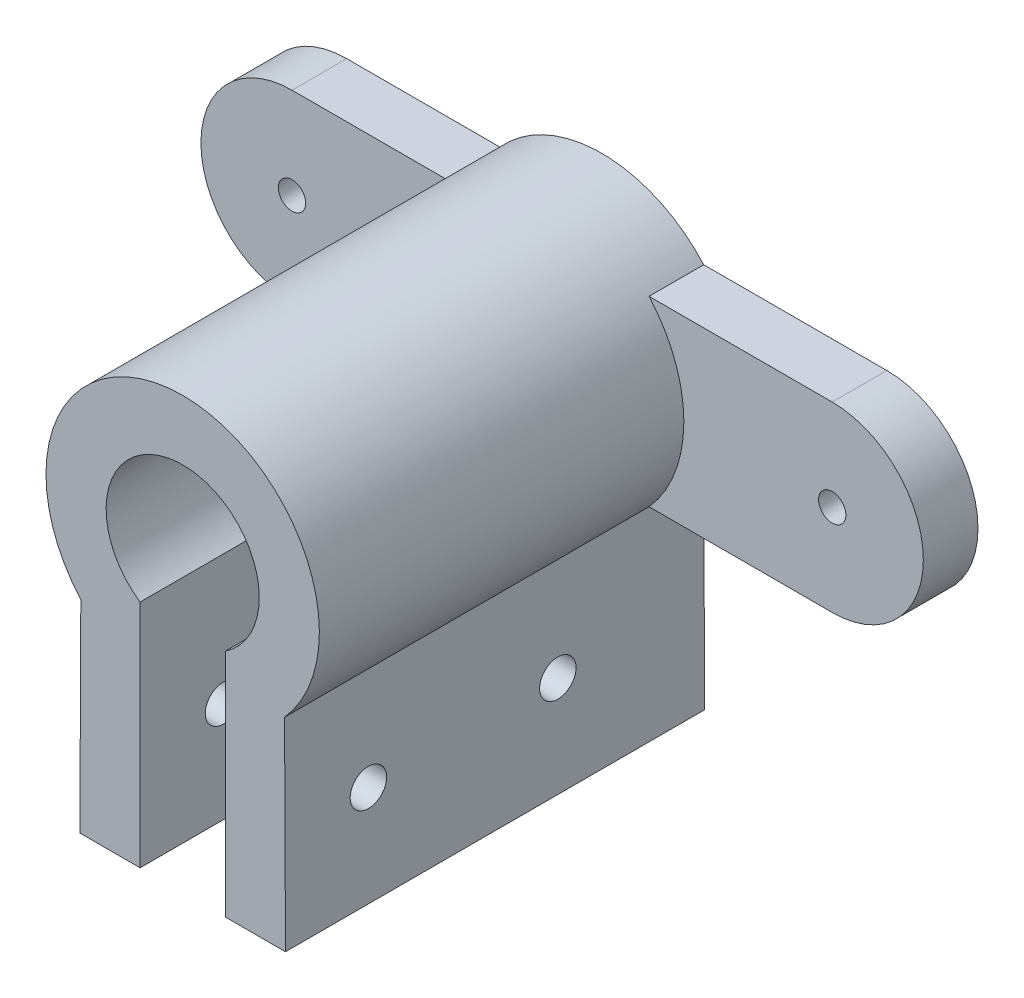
ISO-10303-21;
HEADER;
FILE_DESCRIPTION(('STEP AP214'),'2;1');
FILE_NAME('part.step','',(''),(''),'','','');
FILE_SCHEMA(('AUTOMOTIVE_DESIGN { 1 0 10303 214 1 1 1 1 }'));
ENDSEC;
DATA;
#1=APPLICATION_CONTEXT('core data for automotive mechanical design processes');
#2=APPLICATION_PROTOCOL_DEFINITION('international standard','automotive_design',2000,#1);
#3=PRODUCT_CONTEXT('',#1,'mechanical');
#4=PRODUCT('Part','Part','',(#3));
#5=PRODUCT_RELATED_PRODUCT_CATEGORY('part','',(#4));
#6=PRODUCT_DEFINITION_FORMATION('','',#4);
#7=PRODUCT_DEFINITION_CONTEXT('part definition',#1,'design');
#8=PRODUCT_DEFINITION('design','',#6,#7);
#9=PRODUCT_DEFINITION_SHAPE('','',#8);
#10=(LENGTH_UNIT() NAMED_UNIT(*) SI_UNIT(.MILLI.,.METRE.));
#11=(NAMED_UNIT(*) PLANE_ANGLE_UNIT() SI_UNIT($,.RADIAN.));
#12=(NAMED_UNIT(*) SI_UNIT($,.STERADIAN.) SOLID_ANGLE_UNIT());
#13=UNCERTAINTY_MEASURE_WITH_UNIT(LENGTH_MEASURE(1.E-05),#10,'distance_accuracy_value','');
#14=(GEOMETRIC_REPRESENTATION_CONTEXT(3) GLOBAL_UNCERTAINTY_ASSIGNED_CONTEXT((#13)) GLOBAL_UNIT_ASSIGNED_CONTEXT((#10,
#11,#12)) REPRESENTATION_CONTEXT('',''));
#15=CARTESIAN_POINT('',(0.,0.,0.));
#16=DIRECTION('',(0.,0.,1.));
#17=DIRECTION('',(1.,0.,0.));
#18=AXIS2_PLACEMENT_3D('',#15,#16,#17);
#19=CARTESIAN_POINT('',(-7.13042206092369,-254.782156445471,3.));
#20=DIRECTION('',(0.,0.,1.));
#21=DIRECTION('',(1.,0.,0.));
#22=AXIS2_PLACEMENT_3D('',#19,#20,#21);
#23=PLANE('',#22);
#24=CARTESIAN_POINT('',(-22.7704220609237,-254.782156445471,3.));
#25=DIRECTION('',(0.,0.,1.));
#26=DIRECTION('',(1.,0.,0.));
#27=AXIS2_PLACEMENT_3D('',#24,#25,#26);
#28=CIRCLE('',#27,7.5);
#29=CARTESIAN_POINT('',(-28.3605920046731,-249.782156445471,3.));
#30=VERTEX_POINT('',#29);
#31=CARTESIAN_POINT('',(-28.3605920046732,-259.782156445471,3.));
#32=VERTEX_POINT('',#31);
#33=EDGE_CURVE('E222',#30,#32,#28,.T.);
#34=ORIENTED_EDGE('',*,*,#33,.F.);
#35=DIRECTION('',(-1.,0.,0.));
#36=VECTOR('',#35,1.);
#37=CARTESIAN_POINT('',(-28.3605920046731,-249.782156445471,3.));
#38=LINE('',#37,#36);
#39=CARTESIAN_POINT('',(-36.7704220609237,-249.782156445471,3.));
#40=VERTEX_POINT('',#39);
#41=EDGE_CURVE('E258',#30,#40,#38,.T.);
#42=ORIENTED_EDGE('',*,*,#41,.T.);
#43=CARTESIAN_POINT('',(-36.7704220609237,-254.782156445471,3.));
#44=DIRECTION('',(0.,0.,1.));
#45=DIRECTION('',(1.,0.,0.));
#46=AXIS2_PLACEMENT_3D('',#43,#44,#45);
#47=CIRCLE('',#46,5.);
#48=CARTESIAN_POINT('',(-36.7704220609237,-259.782156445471,3.));
#49=VERTEX_POINT('',#48);
#50=EDGE_CURVE('E260',#40,#49,#47,.T.);
#51=ORIENTED_EDGE('',*,*,#50,.T.);
#52=DIRECTION('',(1.,0.,0.));
#53=VECTOR('',#52,1.);
#54=CARTESIAN_POINT('',(-28.3605920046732,-259.782156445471,3.));
#55=LINE('',#54,#53);
#56=EDGE_CURVE('E262',#49,#32,#55,.T.);
#57=ORIENTED_EDGE('',*,*,#56,.T.);
#58=EDGE_LOOP('',(#34,#42,#51,#57));
#59=FACE_BOUND('',#58,.T.);
#60=CARTESIAN_POINT('',(-36.7704220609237,-254.782156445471,3.));
#61=DIRECTION('',(0.,0.,1.));
#62=DIRECTION('',(1.,0.,0.));
#63=AXIS2_PLACEMENT_3D('',#60,#61,#62);
#64=CIRCLE('',#63,0.749999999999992);
#65=CARTESIAN_POINT('',(-36.0204220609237,-254.782156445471,3.));
#66=VERTEX_POINT('',#65);
#67=EDGE_CURVE('E243',#66,#66,#64,.T.);
#68=ORIENTED_EDGE('',*,*,#67,.F.);
#69=EDGE_LOOP('',(#68));
#70=FACE_BOUND('',#69,.T.);
#71=ADVANCED_FACE('F30',(#59,#70),#23,.T.);
#72=CARTESIAN_POINT('',(-17.1802521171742,-259.782156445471,3.));
#73=VERTEX_POINT('',#72);
#74=CARTESIAN_POINT('',(-17.1802521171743,-249.782156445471,3.));
#75=VERTEX_POINT('',#74);
#76=EDGE_CURVE('E235',#73,#75,#28,.T.);
#77=ORIENTED_EDGE('',*,*,#76,.F.);
#78=DIRECTION('',(1.,0.,0.));
#79=VECTOR('',#78,1.);
#80=CARTESIAN_POINT('',(-7.13042206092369,-259.782156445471,3.));
#81=LINE('',#80,#79);
#82=CARTESIAN_POINT('',(-7.13042206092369,-259.782156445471,3.));
#83=VERTEX_POINT('',#82);
#84=EDGE_CURVE('E49',#73,#83,#81,.T.);
#85=ORIENTED_EDGE('',*,*,#84,.T.);
#86=CARTESIAN_POINT('',(-7.13042206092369,-254.782156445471,3.));
#87=DIRECTION('',(0.,0.,1.));
#88=DIRECTION('',(1.,0.,0.));
#89=AXIS2_PLACEMENT_3D('',#86,#87,#88);
#90=CIRCLE('',#89,5.);
#91=CARTESIAN_POINT('',(-7.13042206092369,-249.782156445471,3.));
#92=VERTEX_POINT('',#91);
#93=EDGE_CURVE('E255',#83,#92,#90,.T.);
#94=ORIENTED_EDGE('',*,*,#93,.T.);
#95=DIRECTION('',(-1.,0.,0.));
#96=VECTOR('',#95,1.);
#97=CARTESIAN_POINT('',(-7.13042206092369,-249.782156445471,3.));
#98=LINE('',#97,#96);
#99=EDGE_CURVE('E91',#92,#75,#98,.T.);
#100=ORIENTED_EDGE('',*,*,#99,.T.);
#101=EDGE_LOOP('',(#77,#85,#94,#100));
#102=FACE_BOUND('',#101,.T.);
#103=CARTESIAN_POINT('',(-7.13042206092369,-254.782156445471,3.));
#104=DIRECTION('',(0.,0.,1.));
#105=DIRECTION('',(1.,0.,0.));
#106=AXIS2_PLACEMENT_3D('',#103,#104,#105);
#107=CIRCLE('',#106,0.750000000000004);
#108=CARTESIAN_POINT('',(-6.38042206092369,-254.782156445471,3.));
#109=VERTEX_POINT('',#108);
#110=EDGE_CURVE('E249',#109,#109,#107,.T.);
#111=ORIENTED_EDGE('',*,*,#110,.F.);
#112=EDGE_LOOP('',(#111));
#113=FACE_BOUND('',#112,.T.);
#114=ADVANCED_FACE('F392',(#102,#113),#23,.T.);
#115=DIRECTION('',(0.,-1.,0.));
#116=VECTOR('',#115,1.);
#117=CARTESIAN_POINT('',(-20.4342487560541,-254.782156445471,3.));
#118=LINE('',#117,#116);
#119=CARTESIAN_POINT('',(-20.4342487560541,-258.272470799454,3.));
#120=VERTEX_POINT('',#119);
#121=CARTESIAN_POINT('',(-20.4342487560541,-261.909027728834,3.));
#122=VERTEX_POINT('',#121);
#123=EDGE_CURVE('E238',#120,#122,#118,.T.);
#124=ORIENTED_EDGE('',*,*,#123,.F.);
#125=CARTESIAN_POINT('',(-22.7704220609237,-254.782156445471,3.));
#126=DIRECTION('',(0.,0.,1.));
#127=DIRECTION('',(1.,0.,0.));
#128=AXIS2_PLACEMENT_3D('',#125,#126,#127);
#129=CIRCLE('',#128,4.2);
#130=CARTESIAN_POINT('',(-25.1065953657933,-258.272470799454,3.));
#131=VERTEX_POINT('',#130);
#132=EDGE_CURVE('E240',#131,#120,#129,.F.);
#133=ORIENTED_EDGE('',*,*,#132,.F.);
#134=DIRECTION('',(0.,1.,0.));
#135=VECTOR('',#134,1.);
#136=CARTESIAN_POINT('',(-25.1065953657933,-254.782156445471,3.));
#137=LINE('',#136,#135);
#138=CARTESIAN_POINT('',(-25.1065953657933,-261.909027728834,3.));
#139=VERTEX_POINT('',#138);
#140=EDGE_CURVE('E236',#139,#131,#137,.T.);
#141=ORIENTED_EDGE('',*,*,#140,.F.);
#142=CARTESIAN_POINT('',(-22.7704220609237,-254.782156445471,3.));
#143=DIRECTION('',(0.,0.,1.));
#144=DIRECTION('',(1.,0.,0.));
#145=AXIS2_PLACEMENT_3D('',#142,#143,#144);
#146=CIRCLE('',#145,7.5);
#147=EDGE_CURVE('E265',#139,#122,#146,.T.);
#148=ORIENTED_EDGE('',*,*,#147,.T.);
#149=EDGE_LOOP('',(#124,#133,#141,#148));
#150=FACE_BOUND('',#149,.T.);
#151=ADVANCED_FACE('F348',(#150),#23,.T.);
#152=CARTESIAN_POINT('',(-7.13042206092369,-254.782156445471,0.));
#153=DIRECTION('',(0.,0.,1.));
#154=DIRECTION('',(1.,0.,0.));
#155=AXIS2_PLACEMENT_3D('',#152,#153,#154);
#156=PLANE('',#155);
#157=DIRECTION('',(0.,-1.,0.));
#158=VECTOR('',#157,1.);
#159=CARTESIAN_POINT('',(-20.4342487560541,-261.909027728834,0.));
#160=LINE('',#159,#158);
#161=CARTESIAN_POINT('',(-20.4342487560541,-261.909027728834,0.));
#162=VERTEX_POINT('',#161);
#163=CARTESIAN_POINT('',(-20.4342487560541,-270.904107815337,0.));
#164=VERTEX_POINT('',#163);
#165=EDGE_CURVE('E214',#162,#164,#160,.T.);
#166=ORIENTED_EDGE('',*,*,#165,.F.);
#167=CARTESIAN_POINT('',(-22.7704220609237,-254.782156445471,0.));
#168=DIRECTION('',(0.,0.,1.));
#169=DIRECTION('',(1.,0.,0.));
#170=AXIS2_PLACEMENT_3D('',#167,#168,#169);
#171=CIRCLE('',#170,7.5);
#172=CARTESIAN_POINT('',(-25.1065953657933,-261.909027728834,0.));
#173=VERTEX_POINT('',#172);
#174=EDGE_CURVE('E283',#173,#162,#171,.T.);
#175=ORIENTED_EDGE('',*,*,#174,.F.);
#176=DIRECTION('',(0.,1.,0.));
#177=VECTOR('',#176,1.);
#178=CARTESIAN_POINT('',(-25.1065953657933,-261.909027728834,0.));
#179=LINE('',#178,#177);
#180=CARTESIAN_POINT('',(-25.1065953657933,-270.904107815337,0.));
#181=VERTEX_POINT('',#180);
#182=EDGE_CURVE('E212',#181,#173,#179,.T.);
#183=ORIENTED_EDGE('',*,*,#182,.F.);
#184=DIRECTION('',(1.,0.,0.));
#185=VECTOR('',#184,1.);
#186=CARTESIAN_POINT('',(-25.1065953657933,-270.904107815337,0.));
#187=LINE('',#186,#185);
#188=CARTESIAN_POINT('',(-28.4116829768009,-270.904107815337,0.));
#189=VERTEX_POINT('',#188);
#190=EDGE_CURVE('E210',#189,#181,#187,.T.);
#191=ORIENTED_EDGE('',*,*,#190,.F.);
#192=DIRECTION('',(-0.00459365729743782,-0.999989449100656,0.));
#193=VECTOR('',#192,1.);
#194=CARTESIAN_POINT('',(-28.4116829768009,-270.904107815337,0.));
#195=LINE('',#194,#193);
#196=CARTESIAN_POINT('',(-28.3605920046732,-259.782156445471,0.));
#197=VERTEX_POINT('',#196);
#198=EDGE_CURVE('E170',#197,#189,#195,.T.);
#199=ORIENTED_EDGE('',*,*,#198,.F.);
#200=DIRECTION('',(1.,0.,0.));
#201=VECTOR('',#200,1.);
#202=CARTESIAN_POINT('',(-28.3605920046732,-259.782156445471,0.));
#203=LINE('',#202,#201);
#204=CARTESIAN_POINT('',(-36.7704220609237,-259.782156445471,0.));
#205=VERTEX_POINT('',#204);
#206=EDGE_CURVE('E280',#205,#197,#203,.T.);
#207=ORIENTED_EDGE('',*,*,#206,.F.);
#208=CARTESIAN_POINT('',(-36.7704220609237,-254.782156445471,0.));
#209=DIRECTION('',(0.,0.,1.));
#210=DIRECTION('',(1.,0.,0.));
#211=AXIS2_PLACEMENT_3D('',#208,#209,#210);
#212=CIRCLE('',#211,5.);
#213=CARTESIAN_POINT('',(-36.7704220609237,-249.782156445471,0.));
#214=VERTEX_POINT('',#213);
#215=EDGE_CURVE('E278',#214,#205,#212,.T.);
#216=ORIENTED_EDGE('',*,*,#215,.F.);
#217=DIRECTION('',(-1.,0.,0.));
#218=VECTOR('',#217,1.);
#219=CARTESIAN_POINT('',(-28.3605920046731,-249.782156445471,0.));
#220=LINE('',#219,#218);
#221=CARTESIAN_POINT('',(-28.3605920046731,-249.782156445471,0.));
#222=VERTEX_POINT('',#221);
#223=EDGE_CURVE('E276',#222,#214,#220,.T.);
#224=ORIENTED_EDGE('',*,*,#223,.F.);
#225=CARTESIAN_POINT('',(-22.7704220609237,-254.782156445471,0.));
#226=DIRECTION('',(0.,0.,1.));
#227=DIRECTION('',(1.,0.,0.));
#228=AXIS2_PLACEMENT_3D('',#225,#226,#227);
#229=CIRCLE('',#228,7.5);
#230=CARTESIAN_POINT('',(-17.1802521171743,-249.782156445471,0.));
#231=VERTEX_POINT('',#230);
#232=EDGE_CURVE('E274',#231,#222,#229,.T.);
#233=ORIENTED_EDGE('',*,*,#232,.F.);
#234=DIRECTION('',(-1.,0.,0.));
#235=VECTOR('',#234,1.);
#236=CARTESIAN_POINT('',(-7.13042206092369,-249.782156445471,0.));
#237=LINE('',#236,#235);
#238=CARTESIAN_POINT('',(-7.13042206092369,-249.782156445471,0.));
#239=VERTEX_POINT('',#238);
#240=EDGE_CURVE('E272',#239,#231,#237,.T.);
#241=ORIENTED_EDGE('',*,*,#240,.F.);
#242=CARTESIAN_POINT('',(-7.13042206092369,-254.782156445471,0.));
#243=DIRECTION('',(0.,0.,1.));
#244=DIRECTION('',(1.,0.,0.));
#245=AXIS2_PLACEMENT_3D('',#242,#243,#244);
#246=CIRCLE('',#245,5.);
#247=CARTESIAN_POINT('',(-7.13042206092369,-259.782156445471,0.));
#248=VERTEX_POINT('',#247);
#249=EDGE_CURVE('E252',#248,#239,#246,.T.);
#250=ORIENTED_EDGE('',*,*,#249,.F.);
#251=DIRECTION('',(1.,0.,0.));
#252=VECTOR('',#251,1.);
#253=CARTESIAN_POINT('',(-7.13042206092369,-259.782156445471,0.));
#254=LINE('',#253,#252);
#255=CARTESIAN_POINT('',(-17.1802521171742,-259.782156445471,0.));
#256=VERTEX_POINT('',#255);
#257=EDGE_CURVE('E83',#256,#248,#254,.T.);
#258=ORIENTED_EDGE('',*,*,#257,.F.);
#259=DIRECTION('',(-0.00459365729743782,0.999989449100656,0.));
#260=VECTOR('',#259,1.);
#261=CARTESIAN_POINT('',(-17.1291611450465,-270.904107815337,0.));
#262=LINE('',#261,#260);
#263=CARTESIAN_POINT('',(-17.1291611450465,-270.904107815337,0.));
#264=VERTEX_POINT('',#263);
#265=EDGE_CURVE('E77',#264,#256,#262,.T.);
#266=ORIENTED_EDGE('',*,*,#265,.F.);
#267=DIRECTION('',(1.,0.,0.));
#268=VECTOR('',#267,1.);
#269=CARTESIAN_POINT('',(-20.4342487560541,-270.904107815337,0.));
#270=LINE('',#269,#268);
#271=EDGE_CURVE('E216',#164,#264,#270,.T.);
#272=ORIENTED_EDGE('',*,*,#271,.F.);
#273=EDGE_LOOP('',(#166,#175,#183,#191,#199,#207,#216,#224,#233,#241,#250,#258,#266,#272));
#274=FACE_BOUND('',#273,.T.);
#275=CARTESIAN_POINT('',(-7.13042206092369,-254.782156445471,0.));
#276=DIRECTION('',(0.,0.,1.));
#277=DIRECTION('',(1.,0.,0.));
#278=AXIS2_PLACEMENT_3D('',#275,#276,#277);
#279=CIRCLE('',#278,0.750000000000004);
#280=CARTESIAN_POINT('',(-6.38042206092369,-254.782156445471,0.));
#281=VERTEX_POINT('',#280);
#282=EDGE_CURVE('E246',#281,#281,#279,.T.);
#283=ORIENTED_EDGE('',*,*,#282,.T.);
#284=EDGE_LOOP('',(#283));
#285=FACE_BOUND('',#284,.T.);
#286=CARTESIAN_POINT('',(-36.7704220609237,-254.782156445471,0.));
#287=DIRECTION('',(0.,0.,1.));
#288=DIRECTION('',(1.,0.,0.));
#289=AXIS2_PLACEMENT_3D('',#286,#287,#288);
#290=CIRCLE('',#289,0.749999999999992);
#291=CARTESIAN_POINT('',(-36.0204220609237,-254.782156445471,0.));
#292=VERTEX_POINT('',#291);
#293=EDGE_CURVE('E242',#292,#292,#290,.T.);
#294=ORIENTED_EDGE('',*,*,#293,.T.);
#295=EDGE_LOOP('',(#294));
#296=FACE_BOUND('',#295,.T.);
#297=ADVANCED_FACE('F357',(#274,#285,#296),#156,.F.);
#298=CARTESIAN_POINT('',(-7.13042206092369,-254.782156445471,3.));
#299=DIRECTION('',(0.,0.,-1.));
#300=DIRECTION('',(-1.,0.,0.));
#301=AXIS2_PLACEMENT_3D('',#298,#299,#300);
#302=CYLINDRICAL_SURFACE('',#301,5.);
#303=ORIENTED_EDGE('',*,*,#249,.T.);
#304=DIRECTION('',(0.,0.,-1.));
#305=VECTOR('',#304,1.);
#306=CARTESIAN_POINT('',(-7.13042206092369,-249.782156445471,3.));
#307=LINE('',#306,#305);
#308=EDGE_CURVE('E304',#92,#239,#307,.T.);
#309=ORIENTED_EDGE('',*,*,#308,.F.);
#310=ORIENTED_EDGE('',*,*,#93,.F.);
#311=DIRECTION('',(0.,0.,-1.));
#312=VECTOR('',#311,1.);
#313=CARTESIAN_POINT('',(-7.13042206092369,-259.782156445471,3.));
#314=LINE('',#313,#312);
#315=EDGE_CURVE('E269',#83,#248,#314,.T.);
#316=ORIENTED_EDGE('',*,*,#315,.T.);
#317=EDGE_LOOP('',(#303,#309,#310,#316));
#318=FACE_BOUND('',#317,.T.);
#319=ADVANCED_FACE('F32',(#318),#302,.T.);
#320=CARTESIAN_POINT('',(-7.13042206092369,-249.782156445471,3.));
#321=DIRECTION('',(0.,-1.,0.));
#322=DIRECTION('',(0.,0.,-1.));
#323=AXIS2_PLACEMENT_3D('',#320,#321,#322);
#324=PLANE('',#323);
#325=ORIENTED_EDGE('',*,*,#240,.T.);
#326=DIRECTION('',(0.,0.,-1.));
#327=VECTOR('',#326,1.);
#328=CARTESIAN_POINT('',(-17.1802521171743,-249.782156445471,3.));
#329=LINE('',#328,#327);
#330=EDGE_CURVE('E301',#75,#231,#329,.T.);
#331=ORIENTED_EDGE('',*,*,#330,.F.);
#332=ORIENTED_EDGE('',*,*,#99,.F.);
#333=ORIENTED_EDGE('',*,*,#308,.T.);
#334=EDGE_LOOP('',(#325,#331,#332,#333));
#335=FACE_BOUND('',#334,.T.);
#336=ADVANCED_FACE('F385',(#335),#324,.F.);
#337=CARTESIAN_POINT('',(-22.7704220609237,-254.782156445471,3.));
#338=DIRECTION('',(0.,0.,-1.));
#339=DIRECTION('',(-1.,0.,0.));
#340=AXIS2_PLACEMENT_3D('',#337,#338,#339);
#341=CYLINDRICAL_SURFACE('',#340,7.5);
#342=ORIENTED_EDGE('',*,*,#232,.T.);
#343=DIRECTION('',(0.,0.,-1.));
#344=VECTOR('',#343,1.);
#345=CARTESIAN_POINT('',(-28.3605920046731,-249.782156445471,3.));
#346=LINE('',#345,#344);
#347=EDGE_CURVE('E298',#30,#222,#346,.T.);
#348=ORIENTED_EDGE('',*,*,#347,.F.);
#349=ORIENTED_EDGE('',*,*,#33,.T.);
#350=DIRECTION('',(0.,0.,1.));
#351=VECTOR('',#350,1.);
#352=CARTESIAN_POINT('',(-28.3605920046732,-259.782156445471,0.));
#353=LINE('',#352,#351);
#354=CARTESIAN_POINT('',(-28.3605920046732,-259.782156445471,23.));
#355=VERTEX_POINT('',#354);
#356=EDGE_CURVE('E220',#32,#355,#353,.T.);
#357=ORIENTED_EDGE('',*,*,#356,.T.);
#358=CARTESIAN_POINT('',(-22.7704220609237,-254.782156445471,23.));
#359=DIRECTION('',(0.,0.,1.));
#360=DIRECTION('',(1.,0.,0.));
#361=AXIS2_PLACEMENT_3D('',#358,#359,#360);
#362=CIRCLE('',#361,7.5);
#363=CARTESIAN_POINT('',(-17.1802521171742,-259.782156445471,23.));
#364=VERTEX_POINT('',#363);
#365=EDGE_CURVE('E188',#364,#355,#362,.T.);
#366=ORIENTED_EDGE('',*,*,#365,.F.);
#367=DIRECTION('',(0.,0.,1.));
#368=VECTOR('',#367,1.);
#369=CARTESIAN_POINT('',(-17.1802521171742,-259.782156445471,0.));
#370=LINE('',#369,#368);
#371=EDGE_CURVE('E223',#73,#364,#370,.T.);
#372=ORIENTED_EDGE('',*,*,#371,.F.);
#373=ORIENTED_EDGE('',*,*,#76,.T.);
#374=ORIENTED_EDGE('',*,*,#330,.T.);
#375=EDGE_LOOP('',(#342,#348,#349,#357,#366,#372,#373,#374));
#376=FACE_BOUND('',#375,.T.);
#377=ADVANCED_FACE('F384',(#376),#341,.T.);
#378=CARTESIAN_POINT('',(-28.3605920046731,-249.782156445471,3.));
#379=DIRECTION('',(0.,-1.,0.));
#380=DIRECTION('',(0.,0.,-1.));
#381=AXIS2_PLACEMENT_3D('',#378,#379,#380);
#382=PLANE('',#381);
#383=ORIENTED_EDGE('',*,*,#223,.T.);
#384=DIRECTION('',(0.,0.,-1.));
#385=VECTOR('',#384,1.);
#386=CARTESIAN_POINT('',(-36.7704220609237,-249.782156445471,3.));
#387=LINE('',#386,#385);
#388=EDGE_CURVE('E295',#40,#214,#387,.T.);
#389=ORIENTED_EDGE('',*,*,#388,.F.);
#390=ORIENTED_EDGE('',*,*,#41,.F.);
#391=ORIENTED_EDGE('',*,*,#347,.T.);
#392=EDGE_LOOP('',(#383,#389,#390,#391));
#393=FACE_BOUND('',#392,.T.);
#394=ADVANCED_FACE('F380',(#393),#382,.F.);
#395=CARTESIAN_POINT('',(-36.7704220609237,-254.782156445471,3.));
#396=DIRECTION('',(0.,0.,-1.));
#397=DIRECTION('',(-1.,0.,0.));
#398=AXIS2_PLACEMENT_3D('',#395,#396,#397);
#399=CYLINDRICAL_SURFACE('',#398,5.);
#400=ORIENTED_EDGE('',*,*,#215,.T.);
#401=DIRECTION('',(0.,0.,-1.));
#402=VECTOR('',#401,1.);
#403=CARTESIAN_POINT('',(-36.7704220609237,-259.782156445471,3.));
#404=LINE('',#403,#402);
#405=EDGE_CURVE('E292',#49,#205,#404,.T.);
#406=ORIENTED_EDGE('',*,*,#405,.F.);
#407=ORIENTED_EDGE('',*,*,#50,.F.);
#408=ORIENTED_EDGE('',*,*,#388,.T.);
#409=EDGE_LOOP('',(#400,#406,#407,#408));
#410=FACE_BOUND('',#409,.T.);
#411=ADVANCED_FACE('F375',(#410),#399,.T.);
#412=CARTESIAN_POINT('',(-28.3605920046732,-259.782156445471,3.));
#413=DIRECTION('',(0.,1.,0.));
#414=DIRECTION('',(0.,0.,1.));
#415=AXIS2_PLACEMENT_3D('',#412,#413,#414);
#416=PLANE('',#415);
#417=ORIENTED_EDGE('',*,*,#206,.T.);
#418=DIRECTION('',(0.,0.,-1.));
#419=VECTOR('',#418,1.);
#420=CARTESIAN_POINT('',(-28.3605920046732,-259.782156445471,3.));
#421=LINE('',#420,#419);
#422=EDGE_CURVE('E290',#32,#197,#421,.T.);
#423=ORIENTED_EDGE('',*,*,#422,.F.);
#424=ORIENTED_EDGE('',*,*,#56,.F.);
#425=ORIENTED_EDGE('',*,*,#405,.T.);
#426=EDGE_LOOP('',(#417,#423,#424,#425));
#427=FACE_BOUND('',#426,.T.);
#428=ADVANCED_FACE('F370',(#427),#416,.F.);
#429=CARTESIAN_POINT('',(-22.7704220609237,-254.782156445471,3.));
#430=DIRECTION('',(0.,0.,-1.));
#431=DIRECTION('',(-1.,0.,0.));
#432=AXIS2_PLACEMENT_3D('',#429,#430,#431);
#433=CYLINDRICAL_SURFACE('',#432,7.5);
#434=ORIENTED_EDGE('',*,*,#174,.T.);
#435=DIRECTION('',(0.,0.,-1.));
#436=VECTOR('',#435,1.);
#437=CARTESIAN_POINT('',(-20.4342487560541,-261.909027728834,3.));
#438=LINE('',#437,#436);
#439=EDGE_CURVE('E11',#162,#122,#438,.F.);
#440=ORIENTED_EDGE('',*,*,#439,.T.);
#441=ORIENTED_EDGE('',*,*,#147,.F.);
#442=DIRECTION('',(0.,0.,-1.));
#443=VECTOR('',#442,1.);
#444=CARTESIAN_POINT('',(-25.1065953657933,-261.909027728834,3.));
#445=LINE('',#444,#443);
#446=EDGE_CURVE('E40',#139,#173,#445,.T.);
#447=ORIENTED_EDGE('',*,*,#446,.T.);
#448=EDGE_LOOP('',(#434,#440,#441,#447));
#449=FACE_BOUND('',#448,.T.);
#450=ADVANCED_FACE('F349',(#449),#433,.T.);
#451=CARTESIAN_POINT('',(-7.13042206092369,-259.782156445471,3.));
#452=DIRECTION('',(0.,1.,0.));
#453=DIRECTION('',(0.,0.,1.));
#454=AXIS2_PLACEMENT_3D('',#451,#452,#453);
#455=PLANE('',#454);
#456=ORIENTED_EDGE('',*,*,#257,.T.);
#457=ORIENTED_EDGE('',*,*,#315,.F.);
#458=ORIENTED_EDGE('',*,*,#84,.F.);
#459=DIRECTION('',(0.,0.,-1.));
#460=VECTOR('',#459,1.);
#461=CARTESIAN_POINT('',(-17.1802521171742,-259.782156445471,3.));
#462=LINE('',#461,#460);
#463=EDGE_CURVE('E288',#73,#256,#462,.T.);
#464=ORIENTED_EDGE('',*,*,#463,.T.);
#465=EDGE_LOOP('',(#456,#457,#458,#464));
#466=FACE_BOUND('',#465,.T.);
#467=ADVANCED_FACE('F390',(#466),#455,.F.);
#468=CARTESIAN_POINT('',(-7.13042206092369,-254.782156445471,3.));
#469=DIRECTION('',(0.,0.,-1.));
#470=DIRECTION('',(-1.,0.,0.));
#471=AXIS2_PLACEMENT_3D('',#468,#469,#470);
#472=CYLINDRICAL_SURFACE('',#471,0.750000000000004);
#473=ORIENTED_EDGE('',*,*,#110,.T.);
#474=EDGE_LOOP('',(#473));
#475=FACE_BOUND('',#474,.T.);
#476=ORIENTED_EDGE('',*,*,#282,.F.);
#477=EDGE_LOOP('',(#476));
#478=FACE_BOUND('',#477,.T.);
#479=ADVANCED_FACE('F398',(#475,#478),#472,.F.);
#480=CARTESIAN_POINT('',(-36.7704220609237,-254.782156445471,3.));
#481=DIRECTION('',(0.,0.,-1.));
#482=DIRECTION('',(-1.,0.,0.));
#483=AXIS2_PLACEMENT_3D('',#480,#481,#482);
#484=CYLINDRICAL_SURFACE('',#483,0.749999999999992);
#485=ORIENTED_EDGE('',*,*,#67,.T.);
#486=EDGE_LOOP('',(#485));
#487=FACE_BOUND('',#486,.T.);
#488=ORIENTED_EDGE('',*,*,#293,.F.);
#489=EDGE_LOOP('',(#488));
#490=FACE_BOUND('',#489,.T.);
#491=ADVANCED_FACE('F401',(#487,#490),#484,.F.);
#492=CARTESIAN_POINT('',(-28.4116829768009,-270.904107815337,0.));
#493=DIRECTION('',(-0.999989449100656,0.00459365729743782,0.));
#494=DIRECTION('',(-0.00459365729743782,-0.999989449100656,0.));
#495=AXIS2_PLACEMENT_3D('',#492,#493,#494);
#496=PLANE('',#495);
#497=CARTESIAN_POINT('',(-28.386137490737,-265.343132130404,18.4258253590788));
#498=DIRECTION('',(-0.999989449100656,0.00459365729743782,0.));
#499=DIRECTION('',(-0.00459365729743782,-0.999989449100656,0.));
#500=AXIS2_PLACEMENT_3D('',#497,#498,#499);
#501=CIRCLE('',#500,1.);
#502=CARTESIAN_POINT('',(-28.3907311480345,-266.343121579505,18.4258253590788));
#503=VERTEX_POINT('',#502);
#504=EDGE_CURVE('E324',#503,#503,#501,.T.);
#505=ORIENTED_EDGE('',*,*,#504,.F.);
#506=EDGE_LOOP('',(#505));
#507=FACE_BOUND('',#506,.T.);
#508=CARTESIAN_POINT('',(-28.386137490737,-265.343132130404,8.03142556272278));
#509=DIRECTION('',(-0.999989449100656,0.00459365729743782,0.));
#510=DIRECTION('',(-0.00459365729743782,-0.999989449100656,0.));
#511=AXIS2_PLACEMENT_3D('',#508,#509,#510);
#512=CIRCLE('',#511,1.);
#513=CARTESIAN_POINT('',(-28.3907311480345,-266.343121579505,8.03142556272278));
#514=VERTEX_POINT('',#513);
#515=EDGE_CURVE('E309',#514,#514,#512,.T.);
#516=ORIENTED_EDGE('',*,*,#515,.F.);
#517=EDGE_LOOP('',(#516));
#518=FACE_BOUND('',#517,.T.);
#519=DIRECTION('',(0.,0.,1.));
#520=VECTOR('',#519,1.);
#521=CARTESIAN_POINT('',(-28.4116829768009,-270.904107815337,0.));
#522=LINE('',#521,#520);
#523=CARTESIAN_POINT('',(-28.4116829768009,-270.904107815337,23.));
#524=VERTEX_POINT('',#523);
#525=EDGE_CURVE('E163',#189,#524,#522,.T.);
#526=ORIENTED_EDGE('',*,*,#525,.T.);
#527=DIRECTION('',(-0.00459365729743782,-0.999989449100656,0.));
#528=VECTOR('',#527,1.);
#529=CARTESIAN_POINT('',(-28.4116829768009,-270.904107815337,23.));
#530=LINE('',#529,#528);
#531=EDGE_CURVE('E168',#355,#524,#530,.T.);
#532=ORIENTED_EDGE('',*,*,#531,.F.);
#533=ORIENTED_EDGE('',*,*,#356,.F.);
#534=ORIENTED_EDGE('',*,*,#422,.T.);
#535=ORIENTED_EDGE('',*,*,#198,.T.);
#536=EDGE_LOOP('',(#526,#532,#533,#534,#535));
#537=FACE_BOUND('',#536,.T.);
#538=ADVANCED_FACE('F165',(#507,#518,#537),#496,.T.);
#539=CARTESIAN_POINT('',(-17.1291611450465,-270.904107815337,0.));
#540=DIRECTION('',(0.999989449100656,0.00459365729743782,0.));
#541=DIRECTION('',(-0.00459365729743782,0.999989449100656,0.));
#542=AXIS2_PLACEMENT_3D('',#539,#540,#541);
#543=PLANE('',#542);
#544=CARTESIAN_POINT('',(-17.154469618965,-265.394727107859,18.4258253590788));
#545=DIRECTION('',(0.999989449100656,0.00459365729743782,0.));
#546=DIRECTION('',(-0.00459365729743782,0.999989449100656,0.));
#547=AXIS2_PLACEMENT_3D('',#544,#545,#546);
#548=ELLIPSE('',#547,1.00004220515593,1.);
#549=CARTESIAN_POINT('',(-17.1590634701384,-264.394695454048,18.4258253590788));
#550=VERTEX_POINT('',#549);
#551=EDGE_CURVE('E314',#550,#550,#548,.T.);
#552=ORIENTED_EDGE('',*,*,#551,.F.);
#553=EDGE_LOOP('',(#552));
#554=FACE_BOUND('',#553,.T.);
#555=CARTESIAN_POINT('',(-17.154469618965,-265.394727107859,8.03142556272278));
#556=DIRECTION('',(0.999989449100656,0.00459365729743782,0.));
#557=DIRECTION('',(-0.00459365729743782,0.999989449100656,0.));
#558=AXIS2_PLACEMENT_3D('',#555,#556,#557);
#559=ELLIPSE('',#558,1.00004220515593,1.);
#560=CARTESIAN_POINT('',(-17.1590634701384,-264.394695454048,8.03142556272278));
#561=VERTEX_POINT('',#560);
#562=EDGE_CURVE('E189',#561,#561,#559,.T.);
#563=ORIENTED_EDGE('',*,*,#562,.F.);
#564=EDGE_LOOP('',(#563));
#565=FACE_BOUND('',#564,.T.);
#566=ORIENTED_EDGE('',*,*,#463,.F.);
#567=ORIENTED_EDGE('',*,*,#371,.T.);
#568=DIRECTION('',(-0.00459365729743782,0.999989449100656,0.));
#569=VECTOR('',#568,1.);
#570=CARTESIAN_POINT('',(-17.1291611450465,-270.904107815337,23.));
#571=LINE('',#570,#569);
#572=CARTESIAN_POINT('',(-17.1291611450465,-270.904107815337,23.));
#573=VERTEX_POINT('',#572);
#574=EDGE_CURVE('E206',#573,#364,#571,.T.);
#575=ORIENTED_EDGE('',*,*,#574,.F.);
#576=DIRECTION('',(0.,0.,1.));
#577=VECTOR('',#576,1.);
#578=CARTESIAN_POINT('',(-17.1291611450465,-270.904107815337,0.));
#579=LINE('',#578,#577);
#580=EDGE_CURVE('E225',#264,#573,#579,.T.);
#581=ORIENTED_EDGE('',*,*,#580,.F.);
#582=ORIENTED_EDGE('',*,*,#265,.T.);
#583=EDGE_LOOP('',(#566,#567,#575,#581,#582));
#584=FACE_BOUND('',#583,.T.);
#585=ADVANCED_FACE('F391',(#554,#565,#584),#543,.T.);
#586=CARTESIAN_POINT('',(-20.4342487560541,-270.904107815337,0.));
#587=DIRECTION('',(0.,-1.,0.));
#588=DIRECTION('',(0.,0.,-1.));
#589=AXIS2_PLACEMENT_3D('',#586,#587,#588);
#590=PLANE('',#589);
#591=ORIENTED_EDGE('',*,*,#580,.T.);
#592=DIRECTION('',(1.,0.,0.));
#593=VECTOR('',#592,1.);
#594=CARTESIAN_POINT('',(-20.4342487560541,-270.904107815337,23.));
#595=LINE('',#594,#593);
#596=CARTESIAN_POINT('',(-20.4342487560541,-270.904107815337,23.));
#597=VERTEX_POINT('',#596);
#598=EDGE_CURVE('E203',#597,#573,#595,.T.);
#599=ORIENTED_EDGE('',*,*,#598,.F.);
#600=DIRECTION('',(0.,0.,1.));
#601=VECTOR('',#600,1.);
#602=CARTESIAN_POINT('',(-20.4342487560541,-270.904107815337,0.));
#603=LINE('',#602,#601);
#604=EDGE_CURVE('E227',#164,#597,#603,.T.);
#605=ORIENTED_EDGE('',*,*,#604,.F.);
#606=ORIENTED_EDGE('',*,*,#271,.T.);
#607=EDGE_LOOP('',(#591,#599,#605,#606));
#608=FACE_BOUND('',#607,.T.);
#609=ADVANCED_FACE('F360',(#608),#590,.T.);
#610=CARTESIAN_POINT('',(-20.4342487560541,-261.909027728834,0.));
#611=DIRECTION('',(-1.,0.,0.));
#612=DIRECTION('',(0.,0.,1.));
#613=AXIS2_PLACEMENT_3D('',#610,#611,#612);
#614=PLANE('',#613);
#615=CARTESIAN_POINT('',(-20.4342487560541,-265.379660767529,18.4258253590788));
#616=DIRECTION('',(-1.,0.,0.));
#617=DIRECTION('',(0.,1.,0.));
#618=AXIS2_PLACEMENT_3D('',#615,#616,#617);
#619=ELLIPSE('',#618,1.00001055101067,1.);
#620=CARTESIAN_POINT('',(-20.4342487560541,-264.379650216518,18.4258253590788));
#621=VERTEX_POINT('',#620);
#622=EDGE_CURVE('E319',#621,#621,#619,.T.);
#623=ORIENTED_EDGE('',*,*,#622,.F.);
#624=EDGE_LOOP('',(#623));
#625=FACE_BOUND('',#624,.T.);
#626=CARTESIAN_POINT('',(-20.4342487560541,-265.379660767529,8.03142556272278));
#627=DIRECTION('',(-1.,0.,0.));
#628=DIRECTION('',(0.,1.,0.));
#629=AXIS2_PLACEMENT_3D('',#626,#627,#628);
#630=ELLIPSE('',#629,1.00001055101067,1.);
#631=CARTESIAN_POINT('',(-20.4342487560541,-264.379650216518,8.03142556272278));
#632=VERTEX_POINT('',#631);
#633=EDGE_CURVE('E192',#632,#632,#630,.T.);
#634=ORIENTED_EDGE('',*,*,#633,.F.);
#635=EDGE_LOOP('',(#634));
#636=FACE_BOUND('',#635,.T.);
#637=DIRECTION('',(0.,0.,1.));
#638=VECTOR('',#637,1.);
#639=CARTESIAN_POINT('',(-20.4342487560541,-258.272470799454,0.));
#640=LINE('',#639,#638);
#641=CARTESIAN_POINT('',(-20.4342487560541,-258.272470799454,23.));
#642=VERTEX_POINT('',#641);
#643=EDGE_CURVE('E229',#120,#642,#640,.T.);
#644=ORIENTED_EDGE('',*,*,#643,.F.);
#645=ORIENTED_EDGE('',*,*,#123,.T.);
#646=ORIENTED_EDGE('',*,*,#439,.F.);
#647=ORIENTED_EDGE('',*,*,#165,.T.);
#648=ORIENTED_EDGE('',*,*,#604,.T.);
#649=DIRECTION('',(0.,-1.,0.));
#650=VECTOR('',#649,1.);
#651=CARTESIAN_POINT('',(-20.4342487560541,-261.909027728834,23.));
#652=LINE('',#651,#650);
#653=EDGE_CURVE('E200',#642,#597,#652,.T.);
#654=ORIENTED_EDGE('',*,*,#653,.F.);
#655=EDGE_LOOP('',(#644,#645,#646,#647,#648,#654));
#656=FACE_BOUND('',#655,.T.);
#657=ADVANCED_FACE('F353',(#625,#636,#656),#614,.T.);
#658=CARTESIAN_POINT('',(-22.7704220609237,-254.782156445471,0.));
#659=DIRECTION('',(0.,0.,1.));
#660=DIRECTION('',(1.,0.,0.));
#661=AXIS2_PLACEMENT_3D('',#658,#659,#660);
#662=CYLINDRICAL_SURFACE('',#661,4.2);
#663=DIRECTION('',(0.,0.,1.));
#664=VECTOR('',#663,1.);
#665=CARTESIAN_POINT('',(-25.1065953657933,-258.272470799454,0.));
#666=LINE('',#665,#664);
#667=CARTESIAN_POINT('',(-25.1065953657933,-258.272470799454,23.));
#668=VERTEX_POINT('',#667);
#669=EDGE_CURVE('E231',#131,#668,#666,.T.);
#670=ORIENTED_EDGE('',*,*,#669,.F.);
#671=ORIENTED_EDGE('',*,*,#132,.T.);
#672=ORIENTED_EDGE('',*,*,#643,.T.);
#673=CARTESIAN_POINT('',(-22.7704220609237,-254.782156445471,23.));
#674=DIRECTION('',(0.,0.,-1.));
#675=DIRECTION('',(1.,0.,0.));
#676=AXIS2_PLACEMENT_3D('',#673,#674,#675);
#677=CIRCLE('',#676,4.2);
#678=EDGE_CURVE('E197',#668,#642,#677,.T.);
#679=ORIENTED_EDGE('',*,*,#678,.F.);
#680=EDGE_LOOP('',(#670,#671,#672,#679));
#681=FACE_BOUND('',#680,.T.);
#682=ADVANCED_FACE('F336',(#681),#662,.F.);
#683=CARTESIAN_POINT('',(-25.1065953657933,-261.909027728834,0.));
#684=DIRECTION('',(1.,0.,0.));
#685=DIRECTION('',(0.,0.,-1.));
#686=AXIS2_PLACEMENT_3D('',#683,#684,#685);
#687=PLANE('',#686);
#688=CARTESIAN_POINT('',(-25.1065953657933,-265.358197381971,18.4258253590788));
#689=DIRECTION('',(1.,0.,0.));
#690=DIRECTION('',(0.,1.,0.));
#691=AXIS2_PLACEMENT_3D('',#688,#689,#690);
#692=ELLIPSE('',#691,1.00001055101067,1.);
#693=CARTESIAN_POINT('',(-25.1065953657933,-264.35818683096,18.4258253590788));
#694=VERTEX_POINT('',#693);
#695=EDGE_CURVE('E34',#694,#694,#692,.T.);
#696=ORIENTED_EDGE('',*,*,#695,.F.);
#697=EDGE_LOOP('',(#696));
#698=FACE_BOUND('',#697,.T.);
#699=CARTESIAN_POINT('',(-25.1065953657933,-265.358197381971,8.03142556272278));
#700=DIRECTION('',(1.,0.,0.));
#701=DIRECTION('',(0.,1.,0.));
#702=AXIS2_PLACEMENT_3D('',#699,#700,#701);
#703=ELLIPSE('',#702,1.00001055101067,1.);
#704=CARTESIAN_POINT('',(-25.1065953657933,-264.35818683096,8.03142556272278));
#705=VERTEX_POINT('',#704);
#706=EDGE_CURVE('E307',#705,#705,#703,.T.);
#707=ORIENTED_EDGE('',*,*,#706,.F.);
#708=EDGE_LOOP('',(#707));
#709=FACE_BOUND('',#708,.T.);
#710=ORIENTED_EDGE('',*,*,#446,.F.);
#711=ORIENTED_EDGE('',*,*,#140,.T.);
#712=ORIENTED_EDGE('',*,*,#669,.T.);
#713=DIRECTION('',(0.,1.,0.));
#714=VECTOR('',#713,1.);
#715=CARTESIAN_POINT('',(-25.1065953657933,-261.909027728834,23.));
#716=LINE('',#715,#714);
#717=CARTESIAN_POINT('',(-25.1065953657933,-270.904107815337,23.));
#718=VERTEX_POINT('',#717);
#719=EDGE_CURVE('E182',#718,#668,#716,.T.);
#720=ORIENTED_EDGE('',*,*,#719,.F.);
#721=DIRECTION('',(0.,0.,1.));
#722=VECTOR('',#721,1.);
#723=CARTESIAN_POINT('',(-25.1065953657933,-270.904107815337,0.));
#724=LINE('',#723,#722);
#725=EDGE_CURVE('E174',#181,#718,#724,.T.);
#726=ORIENTED_EDGE('',*,*,#725,.F.);
#727=ORIENTED_EDGE('',*,*,#182,.T.);
#728=EDGE_LOOP('',(#710,#711,#712,#720,#726,#727));
#729=FACE_BOUND('',#728,.T.);
#730=ADVANCED_FACE('F333',(#698,#709,#729),#687,.T.);
#731=CARTESIAN_POINT('',(-25.1065953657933,-270.904107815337,0.));
#732=DIRECTION('',(0.,-1.,0.));
#733=DIRECTION('',(0.,0.,-1.));
#734=AXIS2_PLACEMENT_3D('',#731,#732,#733);
#735=PLANE('',#734);
#736=ORIENTED_EDGE('',*,*,#725,.T.);
#737=DIRECTION('',(1.,0.,0.));
#738=VECTOR('',#737,1.);
#739=CARTESIAN_POINT('',(-25.1065953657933,-270.904107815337,23.));
#740=LINE('',#739,#738);
#741=EDGE_CURVE('E177',#524,#718,#740,.T.);
#742=ORIENTED_EDGE('',*,*,#741,.F.);
#743=ORIENTED_EDGE('',*,*,#525,.F.);
#744=ORIENTED_EDGE('',*,*,#190,.T.);
#745=EDGE_LOOP('',(#736,#742,#743,#744));
#746=FACE_BOUND('',#745,.T.);
#747=ADVANCED_FACE('F178',(#746),#735,.T.);
#748=CARTESIAN_POINT('',(-22.7704220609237,-254.782156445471,23.));
#749=DIRECTION('',(0.,0.,1.));
#750=DIRECTION('',(1.,0.,0.));
#751=AXIS2_PLACEMENT_3D('',#748,#749,#750);
#752=PLANE('',#751);
#753=ORIENTED_EDGE('',*,*,#531,.T.);
#754=ORIENTED_EDGE('',*,*,#741,.T.);
#755=ORIENTED_EDGE('',*,*,#719,.T.);
#756=ORIENTED_EDGE('',*,*,#678,.T.);
#757=ORIENTED_EDGE('',*,*,#653,.T.);
#758=ORIENTED_EDGE('',*,*,#598,.T.);
#759=ORIENTED_EDGE('',*,*,#574,.T.);
#760=ORIENTED_EDGE('',*,*,#365,.T.);
#761=EDGE_LOOP('',(#753,#754,#755,#756,#757,#758,#759,#760));
#762=FACE_BOUND('',#761,.T.);
#763=ADVANCED_FACE('F185',(#762),#752,.T.);
#764=CARTESIAN_POINT('',(-8.38634850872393,-265.435005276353,8.03142556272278));
#765=DIRECTION('',(-0.999989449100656,0.00459365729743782,0.));
#766=DIRECTION('',(-0.00459365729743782,-0.999989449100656,0.));
#767=AXIS2_PLACEMENT_3D('',#764,#765,#766);
#768=CYLINDRICAL_SURFACE('',#767,1.);
#769=ORIENTED_EDGE('',*,*,#706,.T.);
#770=EDGE_LOOP('',(#769));
#771=FACE_BOUND('',#770,.T.);
#772=ORIENTED_EDGE('',*,*,#515,.T.);
#773=EDGE_LOOP('',(#772));
#774=FACE_BOUND('',#773,.T.);
#775=ADVANCED_FACE('F567',(#771,#774),#768,.F.);
#776=ORIENTED_EDGE('',*,*,#562,.T.);
#777=EDGE_LOOP('',(#776));
#778=FACE_BOUND('',#777,.T.);
#779=ORIENTED_EDGE('',*,*,#633,.T.);
#780=EDGE_LOOP('',(#779));
#781=FACE_BOUND('',#780,.T.);
#782=ADVANCED_FACE('F574',(#778,#781),#768,.F.);
#783=CARTESIAN_POINT('',(-8.38634850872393,-265.435005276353,18.4258253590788));
#784=DIRECTION('',(-0.999989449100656,0.00459365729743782,0.));
#785=DIRECTION('',(-0.00459365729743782,-0.999989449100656,0.));
#786=AXIS2_PLACEMENT_3D('',#783,#784,#785);
#787=CYLINDRICAL_SURFACE('',#786,1.);
#788=ORIENTED_EDGE('',*,*,#695,.T.);
#789=EDGE_LOOP('',(#788));
#790=FACE_BOUND('',#789,.T.);
#791=ORIENTED_EDGE('',*,*,#504,.T.);
#792=EDGE_LOOP('',(#791));
#793=FACE_BOUND('',#792,.T.);
#794=ADVANCED_FACE('F331',(#790,#793),#787,.F.);
#795=ORIENTED_EDGE('',*,*,#551,.T.);
#796=EDGE_LOOP('',(#795));
#797=FACE_BOUND('',#796,.T.);
#798=ORIENTED_EDGE('',*,*,#622,.T.);
#799=EDGE_LOOP('',(#798));
#800=FACE_BOUND('',#799,.T.);
#801=ADVANCED_FACE('F589',(#797,#800),#787,.F.);
#802=CLOSED_SHELL('',(#71,#114,#151,#297,#319,#336,#377,#394,#411,#428,#450,#467,#479,#491,#538,
#585,#609,#657,#682,#730,#747,#763,#775,#782,#794,#801));
#803=MANIFOLD_SOLID_BREP('B2',#802);
#804=ADVANCED_BREP_SHAPE_REPRESENTATION('',(#18,#803),#14);
#805=SHAPE_DEFINITION_REPRESENTATION(#9,#804);
ENDSEC;
END-ISO-10303-21;
